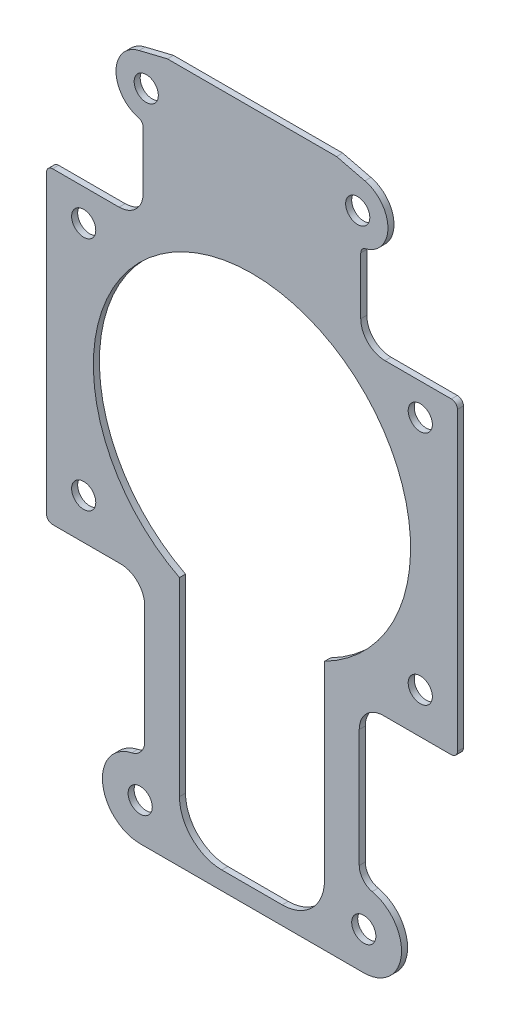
from build123d import *

# Parameters (mm, degrees)
ESQUISSE1_R          = 2
BASE_EXTRUSION_DEPTH = 1


with BuildPart() as part:
    # Esquisse1 → Base-Extrusion (new body)
    with BuildSketch(Plane.XY):
        with BuildLine():
            Line((-18, 102.190524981), (-18, 92.75))
            ThreePointArc((-18, 92.75), (-19.171572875, 89.921572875), (-22, 88.75))
            Line((-22, 88.75), (-33, 88.75))
            ThreePointArc((-33, 88.75), (-33.707106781, 88.457106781), (-34, 87.75))
            Line((-34, 87.75), (-34, 38.75))
            ThreePointArc((-34, 38.75), (-33.707106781, 38.042893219), (-33, 37.75))
            Line((-33, 37.75), (-21.75, 37.75))
            ThreePointArc((-21.75, 37.75), (-18.921572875, 36.578427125), (-17.75, 33.75))
            Line((-17.75, 33.75), (-17.75, 14.274964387))
            ThreePointArc((-17.75, 14.274964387), (-18.35022611, 12.560038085), (-19.888888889, 11.593725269))
            ThreePointArc((-19.888888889, 11.593725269), (-24.710808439, 4.801173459), (-18.5, -0.75))
            Line((-18.5, -0.75), (18.5, -0.75))
            ThreePointArc((18.5, -0.75), (24.710808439, 4.801173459), (19.888888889, 11.593725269))
            ThreePointArc((19.888888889, 11.593725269), (18.35022611, 12.560038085), (17.75, 14.274964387))
            Line((17.75, 14.274964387), (17.75, 33.75))
            ThreePointArc((17.75, 33.75), (18.921572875, 36.578427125), (21.75, 37.75))
            Line((21.75, 37.75), (33, 37.75))
            ThreePointArc((33, 37.75), (33.707106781, 38.042893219), (34, 38.75))
            Line((34, 38.75), (34, 87.75))
            ThreePointArc((34, 87.75), (33.707106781, 88.457106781), (33, 88.75))
            Line((33, 88.75), (22, 88.75))
            ThreePointArc((22, 88.75), (19.171572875, 89.921572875), (18, 92.75))
            Line((18, 92.75), (18, 102.190524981))
            ThreePointArc((18, 102.190524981), (18.209430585, 102.802897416), (18.75, 103.158770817))
            ThreePointArc((18.75, 103.158770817), (22.499886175, 108.033737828), (18.684554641, 112.857656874))
            Line((18.684554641, 112.857656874), (14, 114))
            Line((14, 114), (-14, 114))
            Line((-14, 114), (-18.684554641, 112.857656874))
            ThreePointArc((-18.684554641, 112.857656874), (-22.499886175, 108.033737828), (-18.75, 103.158770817))
            ThreePointArc((-18.75, 103.158770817), (-18.209430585, 102.802897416), (-18, 102.190524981))
        make_face()
        with Locations((-18.5, 5.5)):
            Circle(ESQUISSE1_R, mode=Mode.SUBTRACT)
        with Locations((18.5, 5.5)):
            Circle(ESQUISSE1_R, mode=Mode.SUBTRACT)
        with Locations((-27.851169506, 44.498401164)):
            Circle(ESQUISSE1_R, mode=Mode.SUBTRACT)
        with Locations((27.851169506, 44.498401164)):
            Circle(ESQUISSE1_R, mode=Mode.SUBTRACT)
        with Locations((-27.851169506, 83.501598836)):
            Circle(ESQUISSE1_R, mode=Mode.SUBTRACT)
        with Locations((27.851169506, 83.501598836)):
            Circle(ESQUISSE1_R, mode=Mode.SUBTRACT)
        with Locations((-17.5, 108)):
            Circle(ESQUISSE1_R, mode=Mode.SUBTRACT)
        with Locations((17.5, 108)):
            Circle(ESQUISSE1_R, mode=Mode.SUBTRACT)
        with BuildLine():
            Line((-12, 40.653426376), (-12, 9.25))
            ThreePointArc((-12, 9.25), (-9.949747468, 4.300252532), (-5, 2.25))
            Line((-5, 2.25), (5, 2.25))
            ThreePointArc((5, 2.25), (9.949747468, 4.300252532), (12, 9.25))
            Line((12, 9.25), (12, 40.653426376))
            ThreePointArc((12, 40.653426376), (0, 90.25), (-12, 40.653426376))
        make_face(mode=Mode.SUBTRACT)
    extrude(amount=BASE_EXTRUSION_DEPTH)


solid = part.part
